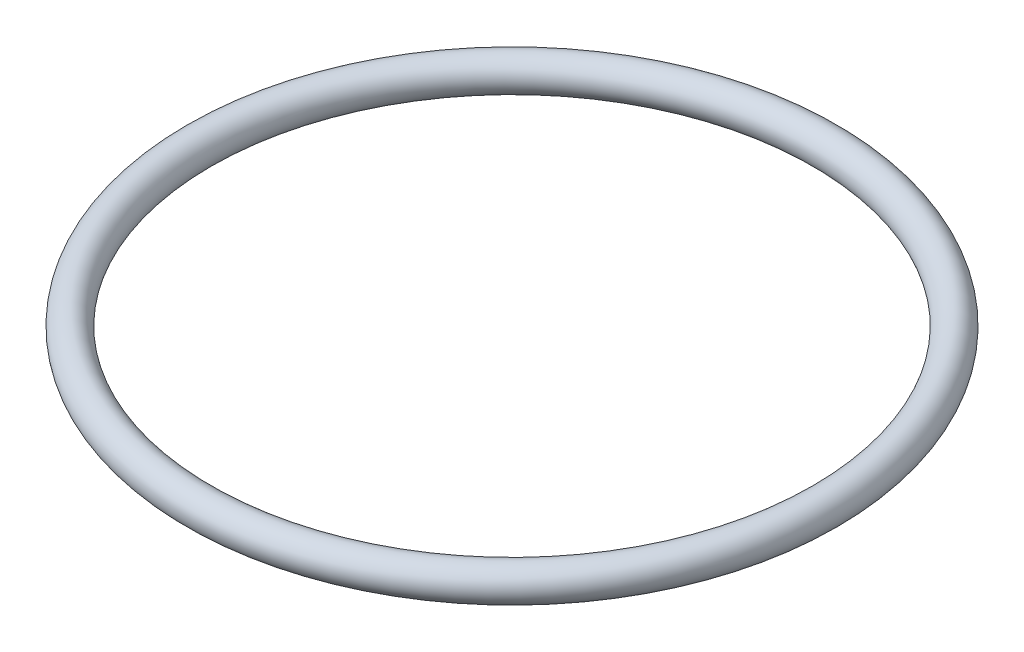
from build123d import *

# Parameters (mm, degrees)
ESQUISSE1_R = 1


with BuildPart() as part:
    # Esquisse1 → R_volution1 (revolve)
    with BuildSketch(Plane.XY):
        with Locations((18.5, 30.3)):
            Circle(ESQUISSE1_R)
    revolve(axis=Axis((0, 10, 0), (0, 1, 0)))


solid = part.part
